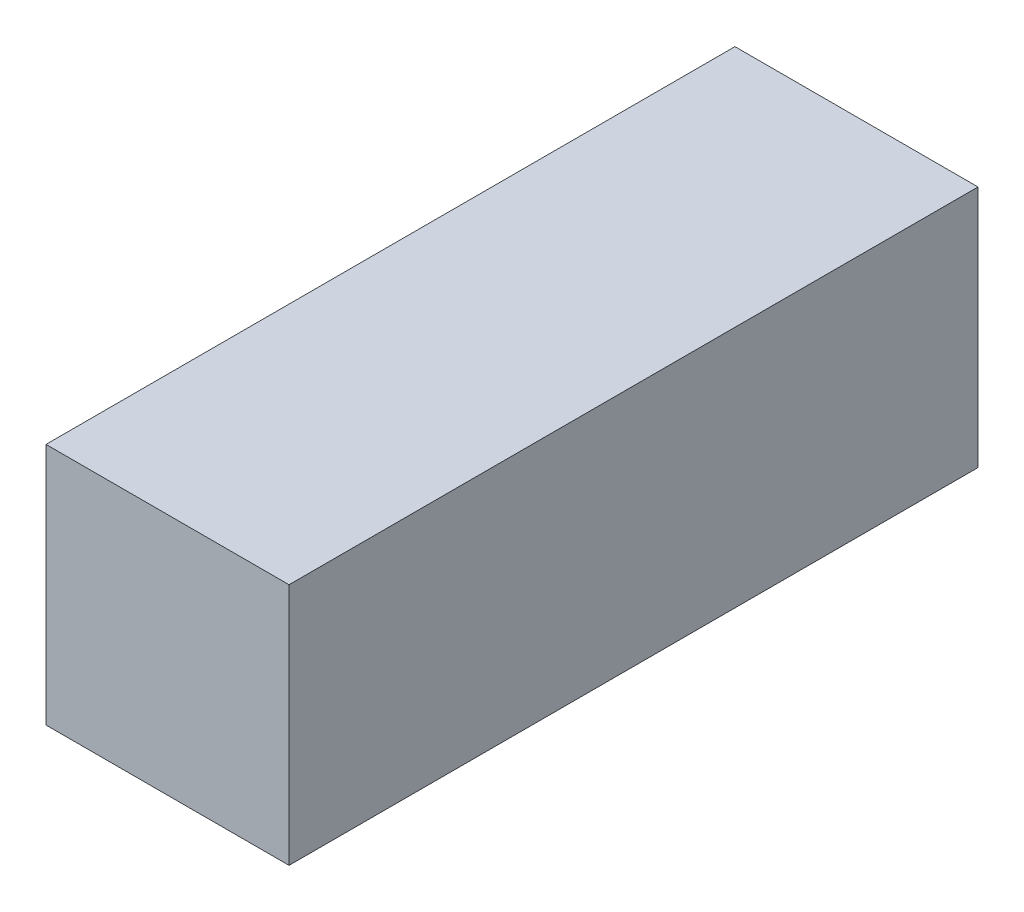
from build123d import *

# Parameters (mm, degrees)
SKETCH1_W           = 3.175
SKETCH1_H           = 3.175
BOSS_EXTRUDE1_DEPTH = 9


with BuildPart() as part:
    # Sketch1 → Boss-Extrude1 (new body)
    with BuildSketch(Plane.XY):
        Rectangle(SKETCH1_W, SKETCH1_H)
    extrude(amount=BOSS_EXTRUDE1_DEPTH)


solid = part.part
